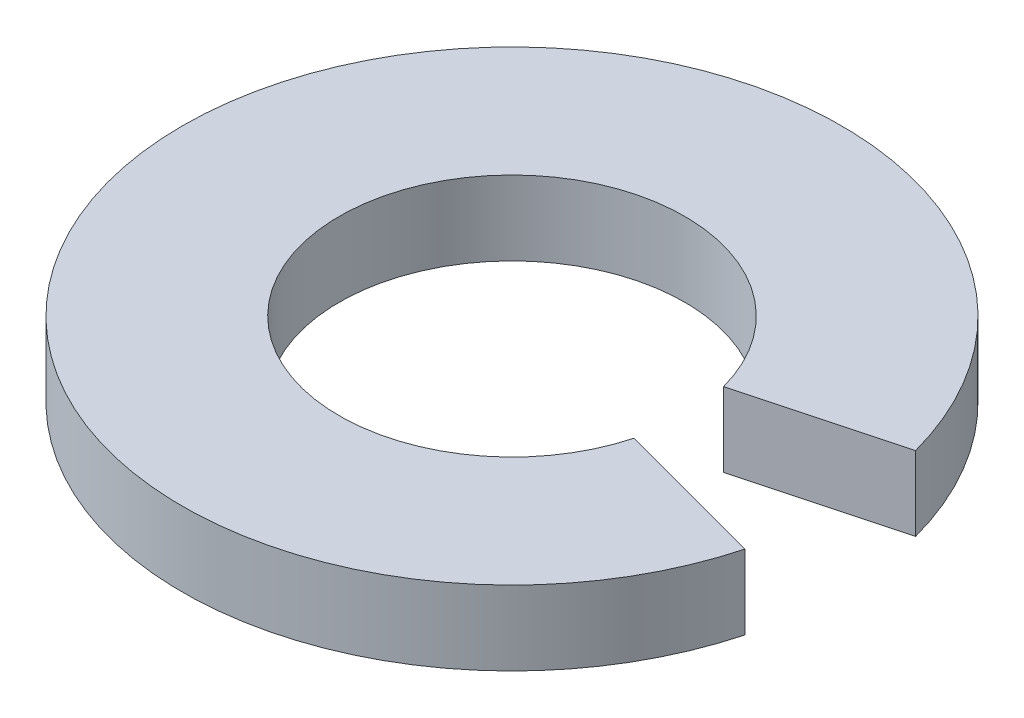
ISO-10303-21;
HEADER;
FILE_DESCRIPTION(('STEP AP214'),'2;1');
FILE_NAME('part.step','',(''),(''),'','','');
FILE_SCHEMA(('AUTOMOTIVE_DESIGN { 1 0 10303 214 1 1 1 1 }'));
ENDSEC;
DATA;
#1=APPLICATION_CONTEXT('core data for automotive mechanical design processes');
#2=APPLICATION_PROTOCOL_DEFINITION('international standard','automotive_design',2000,#1);
#3=PRODUCT_CONTEXT('',#1,'mechanical');
#4=PRODUCT('Part','Part','',(#3));
#5=PRODUCT_RELATED_PRODUCT_CATEGORY('part','',(#4));
#6=PRODUCT_DEFINITION_FORMATION('','',#4);
#7=PRODUCT_DEFINITION_CONTEXT('part definition',#1,'design');
#8=PRODUCT_DEFINITION('design','',#6,#7);
#9=PRODUCT_DEFINITION_SHAPE('','',#8);
#10=(LENGTH_UNIT() NAMED_UNIT(*) SI_UNIT(.MILLI.,.METRE.));
#11=(NAMED_UNIT(*) PLANE_ANGLE_UNIT() SI_UNIT($,.RADIAN.));
#12=(NAMED_UNIT(*) SI_UNIT($,.STERADIAN.) SOLID_ANGLE_UNIT());
#13=UNCERTAINTY_MEASURE_WITH_UNIT(LENGTH_MEASURE(1.E-05),#10,'distance_accuracy_value','');
#14=(GEOMETRIC_REPRESENTATION_CONTEXT(3) GLOBAL_UNCERTAINTY_ASSIGNED_CONTEXT((#13)) GLOBAL_UNIT_ASSIGNED_CONTEXT((#10,
#11,#12)) REPRESENTATION_CONTEXT('',''));
#15=CARTESIAN_POINT('',(0.,0.,0.));
#16=DIRECTION('',(0.,0.,1.));
#17=DIRECTION('',(1.,0.,0.));
#18=AXIS2_PLACEMENT_3D('',#15,#16,#17);
#19=CARTESIAN_POINT('',(0.,0.7,0.));
#20=DIRECTION('',(0.,1.,0.));
#21=DIRECTION('',(0.,0.,1.));
#22=AXIS2_PLACEMENT_3D('',#19,#20,#21);
#23=PLANE('',#22);
#24=CARTESIAN_POINT('',(0.,0.7,0.));
#25=DIRECTION('',(0.,1.,0.));
#26=DIRECTION('',(0.,0.,1.));
#27=AXIS2_PLACEMENT_3D('',#24,#25,#26);
#28=CIRCLE('',#27,1.625);
#29=CARTESIAN_POINT('',(1.56962946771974,0.7,0.420580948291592));
#30=VERTEX_POINT('',#29);
#31=CARTESIAN_POINT('',(1.56962946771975,0.7,-0.420580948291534));
#32=VERTEX_POINT('',#31);
#33=EDGE_CURVE('E67',#30,#32,#28,.F.);
#34=ORIENTED_EDGE('',*,*,#33,.T.);
#35=DIRECTION('',(0.965925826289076,0.,-0.258819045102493));
#36=VECTOR('',#35,1.);
#37=CARTESIAN_POINT('',(1.56962946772,0.7,-0.4205809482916));
#38=LINE('',#37,#36);
#39=CARTESIAN_POINT('',(2.99437006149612,0.7,-0.802339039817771));
#40=VERTEX_POINT('',#39);
#41=EDGE_CURVE('E65',#40,#32,#38,.F.);
#42=ORIENTED_EDGE('',*,*,#41,.F.);
#43=CARTESIAN_POINT('',(0.,0.7,0.));
#44=DIRECTION('',(0.,1.,0.));
#45=DIRECTION('',(0.,0.,1.));
#46=AXIS2_PLACEMENT_3D('',#43,#44,#45);
#47=CIRCLE('',#46,3.1);
#48=CARTESIAN_POINT('',(2.99437006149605,0.7,0.802339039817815));
#49=VERTEX_POINT('',#48);
#50=EDGE_CURVE('E19',#49,#40,#47,.F.);
#51=ORIENTED_EDGE('',*,*,#50,.F.);
#52=DIRECTION('',(-0.965925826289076,0.,-0.258819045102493));
#53=VECTOR('',#52,1.);
#54=CARTESIAN_POINT('',(2.994370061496,0.7,0.8023390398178));
#55=LINE('',#54,#53);
#56=EDGE_CURVE('E52',#30,#49,#55,.F.);
#57=ORIENTED_EDGE('',*,*,#56,.F.);
#58=EDGE_LOOP('',(#34,#42,#51,#57));
#59=FACE_BOUND('',#58,.T.);
#60=ADVANCED_FACE('F16',(#59),#23,.T.);
#61=CARTESIAN_POINT('',(1.56962946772,0.,-0.4205809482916));
#62=DIRECTION('',(0.258819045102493,0.,0.965925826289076));
#63=DIRECTION('',(0.965925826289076,0.,-0.258819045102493));
#64=AXIS2_PLACEMENT_3D('',#61,#62,#63);
#65=PLANE('',#64);
#66=DIRECTION('',(0.,1.,0.));
#67=VECTOR('',#66,1.);
#68=CARTESIAN_POINT('',(1.56962946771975,0.,-0.420580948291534));
#69=LINE('',#68,#67);
#70=CARTESIAN_POINT('',(1.56962946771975,0.,-0.420580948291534));
#71=VERTEX_POINT('',#70);
#72=EDGE_CURVE('E81',#32,#71,#69,.F.);
#73=ORIENTED_EDGE('',*,*,#72,.T.);
#74=DIRECTION('',(0.965925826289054,0.,-0.258819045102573));
#75=VECTOR('',#74,1.);
#76=CARTESIAN_POINT('',(1.56962946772,0.,-0.4205809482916));
#77=LINE('',#76,#75);
#78=CARTESIAN_POINT('',(2.99437006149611,0.,-0.802339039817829));
#79=VERTEX_POINT('',#78);
#80=EDGE_CURVE('E74',#71,#79,#77,.T.);
#81=ORIENTED_EDGE('',*,*,#80,.T.);
#82=DIRECTION('',(0.,1.,0.));
#83=VECTOR('',#82,1.);
#84=CARTESIAN_POINT('',(2.99437006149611,0.,-0.802339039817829));
#85=LINE('',#84,#83);
#86=EDGE_CURVE('E61',#40,#79,#85,.F.);
#87=ORIENTED_EDGE('',*,*,#86,.F.);
#88=ORIENTED_EDGE('',*,*,#41,.T.);
#89=EDGE_LOOP('',(#73,#81,#87,#88));
#90=FACE_BOUND('',#89,.T.);
#91=ADVANCED_FACE('F73',(#90),#65,.T.);
#92=CARTESIAN_POINT('',(0.,0.,0.));
#93=DIRECTION('',(0.,1.,0.));
#94=DIRECTION('',(0.,0.,1.));
#95=AXIS2_PLACEMENT_3D('',#92,#93,#94);
#96=CYLINDRICAL_SURFACE('',#95,3.1);
#97=ORIENTED_EDGE('',*,*,#86,.T.);
#98=CARTESIAN_POINT('',(0.,0.,0.));
#99=DIRECTION('',(0.,1.,0.));
#100=DIRECTION('',(0.,0.,1.));
#101=AXIS2_PLACEMENT_3D('',#98,#99,#100);
#102=CIRCLE('',#101,3.1);
#103=CARTESIAN_POINT('',(2.99437006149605,0.,0.802339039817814));
#104=VERTEX_POINT('',#103);
#105=EDGE_CURVE('E80',#79,#104,#102,.T.);
#106=ORIENTED_EDGE('',*,*,#105,.T.);
#107=DIRECTION('',(0.,1.,0.));
#108=VECTOR('',#107,1.);
#109=CARTESIAN_POINT('',(2.994370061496,0.,0.8023390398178));
#110=LINE('',#109,#108);
#111=EDGE_CURVE('E63',#49,#104,#110,.F.);
#112=ORIENTED_EDGE('',*,*,#111,.F.);
#113=ORIENTED_EDGE('',*,*,#50,.T.);
#114=EDGE_LOOP('',(#97,#106,#112,#113));
#115=FACE_BOUND('',#114,.T.);
#116=ADVANCED_FACE('F58',(#115),#96,.T.);
#117=CARTESIAN_POINT('',(2.994370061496,0.,0.8023390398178));
#118=DIRECTION('',(0.258819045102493,0.,-0.965925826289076));
#119=DIRECTION('',(-0.965925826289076,0.,-0.258819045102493));
#120=AXIS2_PLACEMENT_3D('',#117,#118,#119);
#121=PLANE('',#120);
#122=ORIENTED_EDGE('',*,*,#111,.T.);
#123=DIRECTION('',(-0.965925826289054,0.,-0.258819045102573));
#124=VECTOR('',#123,1.);
#125=CARTESIAN_POINT('',(2.994370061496,0.,0.8023390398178));
#126=LINE('',#125,#124);
#127=CARTESIAN_POINT('',(1.56962946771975,0.,0.420580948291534));
#128=VERTEX_POINT('',#127);
#129=EDGE_CURVE('E25',#104,#128,#126,.T.);
#130=ORIENTED_EDGE('',*,*,#129,.T.);
#131=DIRECTION('',(0.,1.,0.));
#132=VECTOR('',#131,1.);
#133=CARTESIAN_POINT('',(1.56962946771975,0.,0.420580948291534));
#134=LINE('',#133,#132);
#135=EDGE_CURVE('E33',#128,#30,#134,.T.);
#136=ORIENTED_EDGE('',*,*,#135,.T.);
#137=ORIENTED_EDGE('',*,*,#56,.T.);
#138=EDGE_LOOP('',(#122,#130,#136,#137));
#139=FACE_BOUND('',#138,.T.);
#140=ADVANCED_FACE('F87',(#139),#121,.T.);
#141=CARTESIAN_POINT('',(0.,0.,0.));
#142=DIRECTION('',(0.,1.,0.));
#143=DIRECTION('',(0.,0.,1.));
#144=AXIS2_PLACEMENT_3D('',#141,#142,#143);
#145=CYLINDRICAL_SURFACE('',#144,1.625);
#146=ORIENTED_EDGE('',*,*,#33,.F.);
#147=ORIENTED_EDGE('',*,*,#135,.F.);
#148=CARTESIAN_POINT('',(0.,0.,0.));
#149=DIRECTION('',(0.,1.,0.));
#150=DIRECTION('',(0.,0.,1.));
#151=AXIS2_PLACEMENT_3D('',#148,#149,#150);
#152=CIRCLE('',#151,1.625);
#153=EDGE_CURVE('E11',#128,#71,#152,.F.);
#154=ORIENTED_EDGE('',*,*,#153,.T.);
#155=ORIENTED_EDGE('',*,*,#72,.F.);
#156=EDGE_LOOP('',(#146,#147,#154,#155));
#157=FACE_BOUND('',#156,.T.);
#158=ADVANCED_FACE('F90',(#157),#145,.F.);
#159=CARTESIAN_POINT('',(0.,0.,0.));
#160=DIRECTION('',(0.,1.,0.));
#161=DIRECTION('',(0.,0.,1.));
#162=AXIS2_PLACEMENT_3D('',#159,#160,#161);
#163=PLANE('',#162);
#164=ORIENTED_EDGE('',*,*,#129,.F.);
#165=ORIENTED_EDGE('',*,*,#105,.F.);
#166=ORIENTED_EDGE('',*,*,#80,.F.);
#167=ORIENTED_EDGE('',*,*,#153,.F.);
#168=EDGE_LOOP('',(#164,#165,#166,#167));
#169=FACE_BOUND('',#168,.T.);
#170=ADVANCED_FACE('F89',(#169),#163,.F.);
#171=CLOSED_SHELL('',(#60,#91,#116,#140,#158,#170));
#172=MANIFOLD_SOLID_BREP('B1',#171);
#173=ADVANCED_BREP_SHAPE_REPRESENTATION('',(#18,#172),#14);
#174=SHAPE_DEFINITION_REPRESENTATION(#9,#173);
ENDSEC;
END-ISO-10303-21;
